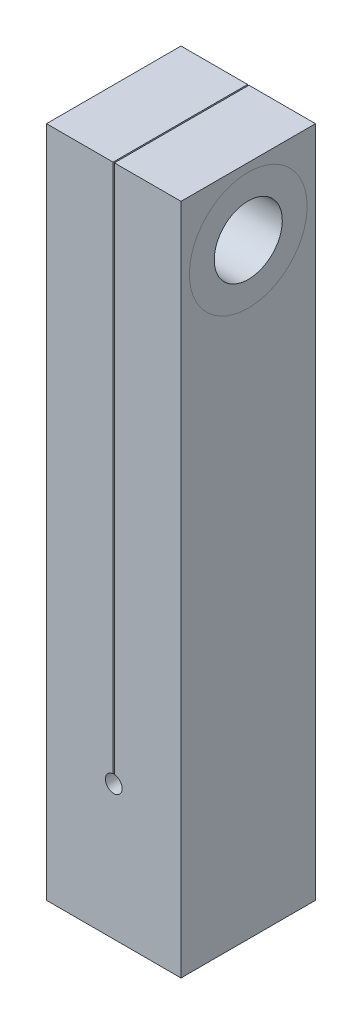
ISO-10303-21;
HEADER;
FILE_DESCRIPTION(('STEP AP214'),'2;1');
FILE_NAME('part.step','',(''),(''),'','','');
FILE_SCHEMA(('AUTOMOTIVE_DESIGN { 1 0 10303 214 1 1 1 1 }'));
ENDSEC;
DATA;
#1=APPLICATION_CONTEXT('core data for automotive mechanical design processes');
#2=APPLICATION_PROTOCOL_DEFINITION('international standard','automotive_design',2000,#1);
#3=PRODUCT_CONTEXT('',#1,'mechanical');
#4=PRODUCT('Part','Part','',(#3));
#5=PRODUCT_RELATED_PRODUCT_CATEGORY('part','',(#4));
#6=PRODUCT_DEFINITION_FORMATION('','',#4);
#7=PRODUCT_DEFINITION_CONTEXT('part definition',#1,'design');
#8=PRODUCT_DEFINITION('design','',#6,#7);
#9=PRODUCT_DEFINITION_SHAPE('','',#8);
#10=(LENGTH_UNIT() NAMED_UNIT(*) SI_UNIT(.MILLI.,.METRE.));
#11=(NAMED_UNIT(*) PLANE_ANGLE_UNIT() SI_UNIT($,.RADIAN.));
#12=(NAMED_UNIT(*) SI_UNIT($,.STERADIAN.) SOLID_ANGLE_UNIT());
#13=UNCERTAINTY_MEASURE_WITH_UNIT(LENGTH_MEASURE(1.E-05),#10,'distance_accuracy_value','');
#14=(GEOMETRIC_REPRESENTATION_CONTEXT(3) GLOBAL_UNCERTAINTY_ASSIGNED_CONTEXT((#13)) GLOBAL_UNIT_ASSIGNED_CONTEXT((#10,
#11,#12)) REPRESENTATION_CONTEXT('',''));
#15=CARTESIAN_POINT('',(0.,0.,0.));
#16=DIRECTION('',(0.,0.,1.));
#17=DIRECTION('',(1.,0.,0.));
#18=AXIS2_PLACEMENT_3D('',#15,#16,#17);
#19=CARTESIAN_POINT('',(-12.7,-25.4,12.7));
#20=DIRECTION('',(1.,0.,0.));
#21=DIRECTION('',(0.,0.,-1.));
#22=AXIS2_PLACEMENT_3D('',#19,#20,#21);
#23=PLANE('',#22);
#24=DIRECTION('',(0.,-1.,0.));
#25=VECTOR('',#24,1.);
#26=CARTESIAN_POINT('',(-12.7,-25.4,-12.7));
#27=LINE('',#26,#25);
#28=CARTESIAN_POINT('',(-12.7,101.6,-12.7));
#29=VERTEX_POINT('',#28);
#30=CARTESIAN_POINT('',(-12.7,-25.4,-12.7));
#31=VERTEX_POINT('',#30);
#32=EDGE_CURVE('E149',#29,#31,#27,.T.);
#33=ORIENTED_EDGE('',*,*,#32,.T.);
#34=DIRECTION('',(0.,0.,-1.));
#35=VECTOR('',#34,1.);
#36=CARTESIAN_POINT('',(-12.7,-25.4,12.7));
#37=LINE('',#36,#35);
#38=CARTESIAN_POINT('',(-12.7,-25.4,12.7));
#39=VERTEX_POINT('',#38);
#40=EDGE_CURVE('E171',#39,#31,#37,.T.);
#41=ORIENTED_EDGE('',*,*,#40,.F.);
#42=DIRECTION('',(0.,-1.,0.));
#43=VECTOR('',#42,1.);
#44=CARTESIAN_POINT('',(-12.7,-25.4,12.7));
#45=LINE('',#44,#43);
#46=CARTESIAN_POINT('',(-12.7,101.6,12.7));
#47=VERTEX_POINT('',#46);
#48=EDGE_CURVE('E164',#47,#39,#45,.T.);
#49=ORIENTED_EDGE('',*,*,#48,.F.);
#50=DIRECTION('',(0.,0.,-1.));
#51=VECTOR('',#50,1.);
#52=CARTESIAN_POINT('',(-12.7,101.6,12.7));
#53=LINE('',#52,#51);
#54=EDGE_CURVE('E148',#47,#29,#53,.T.);
#55=ORIENTED_EDGE('',*,*,#54,.T.);
#56=EDGE_LOOP('',(#33,#41,#49,#55));
#57=FACE_BOUND('',#56,.T.);
#58=CARTESIAN_POINT('',(-12.7,88.9,0.));
#59=DIRECTION('',(1.,0.,0.));
#60=DIRECTION('',(0.,0.,-1.));
#61=AXIS2_PLACEMENT_3D('',#58,#59,#60);
#62=CIRCLE('',#61,11.1125);
#63=CARTESIAN_POINT('',(-12.7,88.9,-11.1125));
#64=VERTEX_POINT('',#63);
#65=EDGE_CURVE('E11',#64,#64,#62,.F.);
#66=ORIENTED_EDGE('',*,*,#65,.F.);
#67=EDGE_LOOP('',(#66));
#68=FACE_BOUND('',#67,.T.);
#69=ADVANCED_FACE('F43',(#57,#68),#23,.F.);
#70=CARTESIAN_POINT('',(12.7,101.6,12.7));
#71=DIRECTION('',(-1.,0.,0.));
#72=DIRECTION('',(0.,-1.,0.));
#73=AXIS2_PLACEMENT_3D('',#70,#71,#72);
#74=PLANE('',#73);
#75=DIRECTION('',(0.,1.,0.));
#76=VECTOR('',#75,1.);
#77=CARTESIAN_POINT('',(12.7,101.6,-12.7));
#78=LINE('',#77,#76);
#79=CARTESIAN_POINT('',(12.7,-25.4,-12.7));
#80=VERTEX_POINT('',#79);
#81=CARTESIAN_POINT('',(12.7,101.6,-12.7));
#82=VERTEX_POINT('',#81);
#83=EDGE_CURVE('E156',#80,#82,#78,.T.);
#84=ORIENTED_EDGE('',*,*,#83,.T.);
#85=DIRECTION('',(0.,0.,-1.));
#86=VECTOR('',#85,1.);
#87=CARTESIAN_POINT('',(12.7,101.6,12.7));
#88=LINE('',#87,#86);
#89=CARTESIAN_POINT('',(12.7,101.6,12.7));
#90=VERTEX_POINT('',#89);
#91=EDGE_CURVE('E135',#90,#82,#88,.T.);
#92=ORIENTED_EDGE('',*,*,#91,.F.);
#93=DIRECTION('',(0.,1.,0.));
#94=VECTOR('',#93,1.);
#95=CARTESIAN_POINT('',(12.7,101.6,12.7));
#96=LINE('',#95,#94);
#97=CARTESIAN_POINT('',(12.7,-25.4,12.7));
#98=VERTEX_POINT('',#97);
#99=EDGE_CURVE('E122',#98,#90,#96,.T.);
#100=ORIENTED_EDGE('',*,*,#99,.F.);
#101=DIRECTION('',(0.,0.,-1.));
#102=VECTOR('',#101,1.);
#103=CARTESIAN_POINT('',(12.7,-25.4,12.7));
#104=LINE('',#103,#102);
#105=EDGE_CURVE('E168',#98,#80,#104,.T.);
#106=ORIENTED_EDGE('',*,*,#105,.T.);
#107=EDGE_LOOP('',(#84,#92,#100,#106));
#108=FACE_BOUND('',#107,.T.);
#109=CARTESIAN_POINT('',(12.7,88.9,0.));
#110=DIRECTION('',(-1.,0.,0.));
#111=DIRECTION('',(0.,-1.,0.));
#112=AXIS2_PLACEMENT_3D('',#109,#110,#111);
#113=CIRCLE('',#112,11.1125);
#114=CARTESIAN_POINT('',(12.7,77.7875,0.));
#115=VERTEX_POINT('',#114);
#116=EDGE_CURVE('E47',#115,#115,#113,.F.);
#117=ORIENTED_EDGE('',*,*,#116,.F.);
#118=EDGE_LOOP('',(#117));
#119=FACE_BOUND('',#118,.T.);
#120=ADVANCED_FACE('F192',(#108,#119),#74,.F.);
#121=ORIENTED_EDGE('',*,*,#65,.T.);
#122=EDGE_LOOP('',(#121));
#123=FACE_BOUND('',#122,.T.);
#124=CARTESIAN_POINT('',(-12.7,88.9,0.));
#125=DIRECTION('',(1.,0.,0.));
#126=DIRECTION('',(0.,1.,0.));
#127=AXIS2_PLACEMENT_3D('',#124,#125,#126);
#128=CIRCLE('',#127,6.4262);
#129=CARTESIAN_POINT('',(-12.7,95.3262,0.));
#130=VERTEX_POINT('',#129);
#131=EDGE_CURVE('E178',#130,#130,#128,.T.);
#132=ORIENTED_EDGE('',*,*,#131,.T.);
#133=EDGE_LOOP('',(#132));
#134=FACE_BOUND('',#133,.T.);
#135=ADVANCED_FACE('F45',(#123,#134),#23,.F.);
#136=CARTESIAN_POINT('',(12.7,-25.4,12.7));
#137=DIRECTION('',(0.,1.,0.));
#138=DIRECTION('',(-1.,0.,0.));
#139=AXIS2_PLACEMENT_3D('',#136,#137,#138);
#140=PLANE('',#139);
#141=DIRECTION('',(1.,0.,0.));
#142=VECTOR('',#141,1.);
#143=CARTESIAN_POINT('',(12.7,-25.4,-12.7));
#144=LINE('',#143,#142);
#145=EDGE_CURVE('E153',#31,#80,#144,.T.);
#146=ORIENTED_EDGE('',*,*,#145,.T.);
#147=ORIENTED_EDGE('',*,*,#105,.F.);
#148=DIRECTION('',(1.,0.,0.));
#149=VECTOR('',#148,1.);
#150=CARTESIAN_POINT('',(12.7,-25.4,12.7));
#151=LINE('',#150,#149);
#152=EDGE_CURVE('E104',#39,#98,#151,.T.);
#153=ORIENTED_EDGE('',*,*,#152,.F.);
#154=ORIENTED_EDGE('',*,*,#40,.T.);
#155=EDGE_LOOP('',(#146,#147,#153,#154));
#156=FACE_BOUND('',#155,.T.);
#157=ADVANCED_FACE('F200',(#156),#140,.F.);
#158=ORIENTED_EDGE('',*,*,#116,.T.);
#159=EDGE_LOOP('',(#158));
#160=FACE_BOUND('',#159,.T.);
#161=CARTESIAN_POINT('',(12.7,88.9,0.));
#162=DIRECTION('',(1.,0.,0.));
#163=DIRECTION('',(0.,1.,0.));
#164=AXIS2_PLACEMENT_3D('',#161,#162,#163);
#165=CIRCLE('',#164,6.4262);
#166=CARTESIAN_POINT('',(12.7,95.3262,0.));
#167=VERTEX_POINT('',#166);
#168=EDGE_CURVE('E235',#167,#167,#165,.T.);
#169=ORIENTED_EDGE('',*,*,#168,.F.);
#170=EDGE_LOOP('',(#169));
#171=FACE_BOUND('',#170,.T.);
#172=ADVANCED_FACE('F189',(#160,#171),#74,.F.);
#173=CARTESIAN_POINT('',(0.126999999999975,101.6,12.7));
#174=DIRECTION('',(0.,-1.,0.));
#175=DIRECTION('',(0.,0.,-1.));
#176=AXIS2_PLACEMENT_3D('',#173,#174,#175);
#177=PLANE('',#176);
#178=DIRECTION('',(-1.,0.,0.));
#179=VECTOR('',#178,1.);
#180=CARTESIAN_POINT('',(0.126999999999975,101.6,-12.7));
#181=LINE('',#180,#179);
#182=CARTESIAN_POINT('',(0.126999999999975,101.6,-12.7));
#183=VERTEX_POINT('',#182);
#184=EDGE_CURVE('E131',#82,#183,#181,.T.);
#185=ORIENTED_EDGE('',*,*,#184,.T.);
#186=DIRECTION('',(0.,0.,-1.));
#187=VECTOR('',#186,1.);
#188=CARTESIAN_POINT('',(0.126999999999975,101.6,12.7));
#189=LINE('',#188,#187);
#190=CARTESIAN_POINT('',(0.126999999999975,101.6,12.7));
#191=VERTEX_POINT('',#190);
#192=EDGE_CURVE('E128',#191,#183,#189,.T.);
#193=ORIENTED_EDGE('',*,*,#192,.F.);
#194=DIRECTION('',(-1.,0.,0.));
#195=VECTOR('',#194,1.);
#196=CARTESIAN_POINT('',(0.126999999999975,101.6,12.7));
#197=LINE('',#196,#195);
#198=EDGE_CURVE('E114',#90,#191,#197,.T.);
#199=ORIENTED_EDGE('',*,*,#198,.F.);
#200=ORIENTED_EDGE('',*,*,#91,.T.);
#201=EDGE_LOOP('',(#185,#193,#199,#200));
#202=FACE_BOUND('',#201,.T.);
#203=ADVANCED_FACE('F129',(#202),#177,.F.);
#204=CARTESIAN_POINT('',(0.127,0.,12.7));
#205=DIRECTION('',(1.,0.,0.));
#206=DIRECTION('',(0.,1.,0.));
#207=AXIS2_PLACEMENT_3D('',#204,#205,#206);
#208=PLANE('',#207);
#209=CARTESIAN_POINT('',(0.126999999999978,88.9,0.));
#210=DIRECTION('',(1.,0.,0.));
#211=DIRECTION('',(0.,1.,0.));
#212=AXIS2_PLACEMENT_3D('',#209,#210,#211);
#213=CIRCLE('',#212,6.4262);
#214=CARTESIAN_POINT('',(0.126999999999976,95.3262,0.));
#215=VERTEX_POINT('',#214);
#216=EDGE_CURVE('E154',#215,#215,#213,.T.);
#217=ORIENTED_EDGE('',*,*,#216,.T.);
#218=EDGE_LOOP('',(#217));
#219=FACE_BOUND('',#218,.T.);
#220=DIRECTION('',(0.,-1.,0.));
#221=VECTOR('',#220,1.);
#222=CARTESIAN_POINT('',(0.127,0.,-12.7));
#223=LINE('',#222,#221);
#224=CARTESIAN_POINT('',(0.127,1.58241184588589,-12.7));
#225=VERTEX_POINT('',#224);
#226=EDGE_CURVE('E159',#183,#225,#223,.T.);
#227=ORIENTED_EDGE('',*,*,#226,.T.);
#228=DIRECTION('',(0.,0.,1.));
#229=VECTOR('',#228,1.);
#230=CARTESIAN_POINT('',(0.127,1.58241184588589,-12.7));
#231=LINE('',#230,#229);
#232=CARTESIAN_POINT('',(0.127,1.58241184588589,12.7));
#233=VERTEX_POINT('',#232);
#234=EDGE_CURVE('E59',#225,#233,#231,.T.);
#235=ORIENTED_EDGE('',*,*,#234,.T.);
#236=DIRECTION('',(0.,-1.,0.));
#237=VECTOR('',#236,1.);
#238=CARTESIAN_POINT('',(0.127,0.,12.7));
#239=LINE('',#238,#237);
#240=EDGE_CURVE('E120',#191,#233,#239,.T.);
#241=ORIENTED_EDGE('',*,*,#240,.F.);
#242=ORIENTED_EDGE('',*,*,#192,.T.);
#243=EDGE_LOOP('',(#227,#235,#241,#242));
#244=FACE_BOUND('',#243,.T.);
#245=ADVANCED_FACE('F138',(#219,#244),#208,.F.);
#246=CARTESIAN_POINT('',(-0.127000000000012,101.6,12.7));
#247=DIRECTION('',(-1.,0.,0.));
#248=DIRECTION('',(0.,-1.,0.));
#249=AXIS2_PLACEMENT_3D('',#246,#247,#248);
#250=PLANE('',#249);
#251=CARTESIAN_POINT('',(-0.127000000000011,88.9,0.));
#252=DIRECTION('',(-1.,0.,0.));
#253=DIRECTION('',(0.,-1.,0.));
#254=AXIS2_PLACEMENT_3D('',#251,#252,#253);
#255=CIRCLE('',#254,6.4262);
#256=CARTESIAN_POINT('',(-0.12700000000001,82.4738,0.));
#257=VERTEX_POINT('',#256);
#258=EDGE_CURVE('E174',#257,#257,#255,.T.);
#259=ORIENTED_EDGE('',*,*,#258,.T.);
#260=EDGE_LOOP('',(#259));
#261=FACE_BOUND('',#260,.T.);
#262=DIRECTION('',(0.,1.,0.));
#263=VECTOR('',#262,1.);
#264=CARTESIAN_POINT('',(-0.127000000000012,101.6,12.7));
#265=LINE('',#264,#263);
#266=CARTESIAN_POINT('',(-0.127,1.58241184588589,12.7));
#267=VERTEX_POINT('',#266);
#268=CARTESIAN_POINT('',(-0.127000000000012,101.6,12.7));
#269=VERTEX_POINT('',#268);
#270=EDGE_CURVE('E140',#267,#269,#265,.T.);
#271=ORIENTED_EDGE('',*,*,#270,.F.);
#272=DIRECTION('',(0.,0.,1.));
#273=VECTOR('',#272,1.);
#274=CARTESIAN_POINT('',(-0.127,1.58241184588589,-12.7));
#275=LINE('',#274,#273);
#276=CARTESIAN_POINT('',(-0.127,1.58241184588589,-12.7));
#277=VERTEX_POINT('',#276);
#278=EDGE_CURVE('E222',#267,#277,#275,.F.);
#279=ORIENTED_EDGE('',*,*,#278,.T.);
#280=DIRECTION('',(0.,1.,0.));
#281=VECTOR('',#280,1.);
#282=CARTESIAN_POINT('',(-0.127000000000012,101.6,-12.7));
#283=LINE('',#282,#281);
#284=CARTESIAN_POINT('',(-0.127000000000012,101.6,-12.7));
#285=VERTEX_POINT('',#284);
#286=EDGE_CURVE('E161',#277,#285,#283,.T.);
#287=ORIENTED_EDGE('',*,*,#286,.T.);
#288=DIRECTION('',(0.,0.,-1.));
#289=VECTOR('',#288,1.);
#290=CARTESIAN_POINT('',(-0.127000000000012,101.6,12.7));
#291=LINE('',#290,#289);
#292=EDGE_CURVE('E136',#269,#285,#291,.T.);
#293=ORIENTED_EDGE('',*,*,#292,.F.);
#294=EDGE_LOOP('',(#271,#279,#287,#293));
#295=FACE_BOUND('',#294,.T.);
#296=ADVANCED_FACE('F221',(#261,#295),#250,.F.);
#297=CARTESIAN_POINT('',(-12.7,101.6,12.7));
#298=DIRECTION('',(0.,-1.,0.));
#299=DIRECTION('',(0.,0.,-1.));
#300=AXIS2_PLACEMENT_3D('',#297,#298,#299);
#301=PLANE('',#300);
#302=DIRECTION('',(-1.,0.,0.));
#303=VECTOR('',#302,1.);
#304=CARTESIAN_POINT('',(-12.7,101.6,-12.7));
#305=LINE('',#304,#303);
#306=EDGE_CURVE('E95',#285,#29,#305,.T.);
#307=ORIENTED_EDGE('',*,*,#306,.T.);
#308=ORIENTED_EDGE('',*,*,#54,.F.);
#309=DIRECTION('',(-1.,0.,0.));
#310=VECTOR('',#309,1.);
#311=CARTESIAN_POINT('',(-12.7,101.6,12.7));
#312=LINE('',#311,#310);
#313=EDGE_CURVE('E68',#269,#47,#312,.T.);
#314=ORIENTED_EDGE('',*,*,#313,.F.);
#315=ORIENTED_EDGE('',*,*,#292,.T.);
#316=EDGE_LOOP('',(#307,#308,#314,#315));
#317=FACE_BOUND('',#316,.T.);
#318=ADVANCED_FACE('F223',(#317),#301,.F.);
#319=CARTESIAN_POINT('',(0.,0.,12.7));
#320=DIRECTION('',(0.,0.,-1.));
#321=DIRECTION('',(-1.,0.,0.));
#322=AXIS2_PLACEMENT_3D('',#319,#320,#321);
#323=PLANE('',#322);
#324=ORIENTED_EDGE('',*,*,#240,.T.);
#325=CARTESIAN_POINT('',(0.,0.,12.7));
#326=DIRECTION('',(0.,0.,1.));
#327=DIRECTION('',(1.,0.,0.));
#328=AXIS2_PLACEMENT_3D('',#325,#326,#327);
#329=CIRCLE('',#328,1.5875);
#330=EDGE_CURVE('E243',#267,#233,#329,.T.);
#331=ORIENTED_EDGE('',*,*,#330,.F.);
#332=ORIENTED_EDGE('',*,*,#270,.T.);
#333=ORIENTED_EDGE('',*,*,#313,.T.);
#334=ORIENTED_EDGE('',*,*,#48,.T.);
#335=ORIENTED_EDGE('',*,*,#152,.T.);
#336=ORIENTED_EDGE('',*,*,#99,.T.);
#337=ORIENTED_EDGE('',*,*,#198,.T.);
#338=EDGE_LOOP('',(#324,#331,#332,#333,#334,#335,#336,#337));
#339=FACE_BOUND('',#338,.T.);
#340=ADVANCED_FACE('F116',(#339),#323,.F.);
#341=CARTESIAN_POINT('',(0.,0.,-12.7));
#342=DIRECTION('',(0.,0.,-1.));
#343=DIRECTION('',(-1.,0.,0.));
#344=AXIS2_PLACEMENT_3D('',#341,#342,#343);
#345=PLANE('',#344);
#346=CARTESIAN_POINT('',(0.,0.,-12.7));
#347=DIRECTION('',(0.,0.,-1.));
#348=DIRECTION('',(-1.,0.,0.));
#349=AXIS2_PLACEMENT_3D('',#346,#347,#348);
#350=CIRCLE('',#349,1.5875);
#351=EDGE_CURVE('E173',#225,#277,#350,.T.);
#352=ORIENTED_EDGE('',*,*,#351,.F.);
#353=ORIENTED_EDGE('',*,*,#226,.F.);
#354=ORIENTED_EDGE('',*,*,#184,.F.);
#355=ORIENTED_EDGE('',*,*,#83,.F.);
#356=ORIENTED_EDGE('',*,*,#145,.F.);
#357=ORIENTED_EDGE('',*,*,#32,.F.);
#358=ORIENTED_EDGE('',*,*,#306,.F.);
#359=ORIENTED_EDGE('',*,*,#286,.F.);
#360=EDGE_LOOP('',(#352,#353,#354,#355,#356,#357,#358,#359));
#361=FACE_BOUND('',#360,.T.);
#362=ADVANCED_FACE('F215',(#361),#345,.T.);
#363=CARTESIAN_POINT('',(-12.7,88.9,0.));
#364=DIRECTION('',(1.,0.,0.));
#365=DIRECTION('',(0.,1.,0.));
#366=AXIS2_PLACEMENT_3D('',#363,#364,#365);
#367=CYLINDRICAL_SURFACE('',#366,6.4262);
#368=ORIENTED_EDGE('',*,*,#131,.F.);
#369=EDGE_LOOP('',(#368));
#370=FACE_BOUND('',#369,.T.);
#371=ORIENTED_EDGE('',*,*,#258,.F.);
#372=EDGE_LOOP('',(#371));
#373=FACE_BOUND('',#372,.T.);
#374=ADVANCED_FACE('F251',(#370,#373),#367,.F.);
#375=ORIENTED_EDGE('',*,*,#168,.T.);
#376=EDGE_LOOP('',(#375));
#377=FACE_BOUND('',#376,.T.);
#378=ORIENTED_EDGE('',*,*,#216,.F.);
#379=EDGE_LOOP('',(#378));
#380=FACE_BOUND('',#379,.T.);
#381=ADVANCED_FACE('F246',(#377,#380),#367,.F.);
#382=CARTESIAN_POINT('',(0.,0.,-12.7));
#383=DIRECTION('',(0.,0.,1.));
#384=DIRECTION('',(1.,0.,0.));
#385=AXIS2_PLACEMENT_3D('',#382,#383,#384);
#386=CYLINDRICAL_SURFACE('',#385,1.5875);
#387=ORIENTED_EDGE('',*,*,#351,.T.);
#388=ORIENTED_EDGE('',*,*,#278,.F.);
#389=ORIENTED_EDGE('',*,*,#330,.T.);
#390=ORIENTED_EDGE('',*,*,#234,.F.);
#391=EDGE_LOOP('',(#387,#388,#389,#390));
#392=FACE_BOUND('',#391,.T.);
#393=ADVANCED_FACE('F244',(#392),#386,.F.);
#394=CLOSED_SHELL('',(#69,#120,#135,#157,#172,#203,#245,#296,#318,#340,#362,#374,#381,#393));
#395=MANIFOLD_SOLID_BREP('B2',#394);
#396=ADVANCED_BREP_SHAPE_REPRESENTATION('',(#18,#395),#14);
#397=SHAPE_DEFINITION_REPRESENTATION(#9,#396);
ENDSEC;
END-ISO-10303-21;
